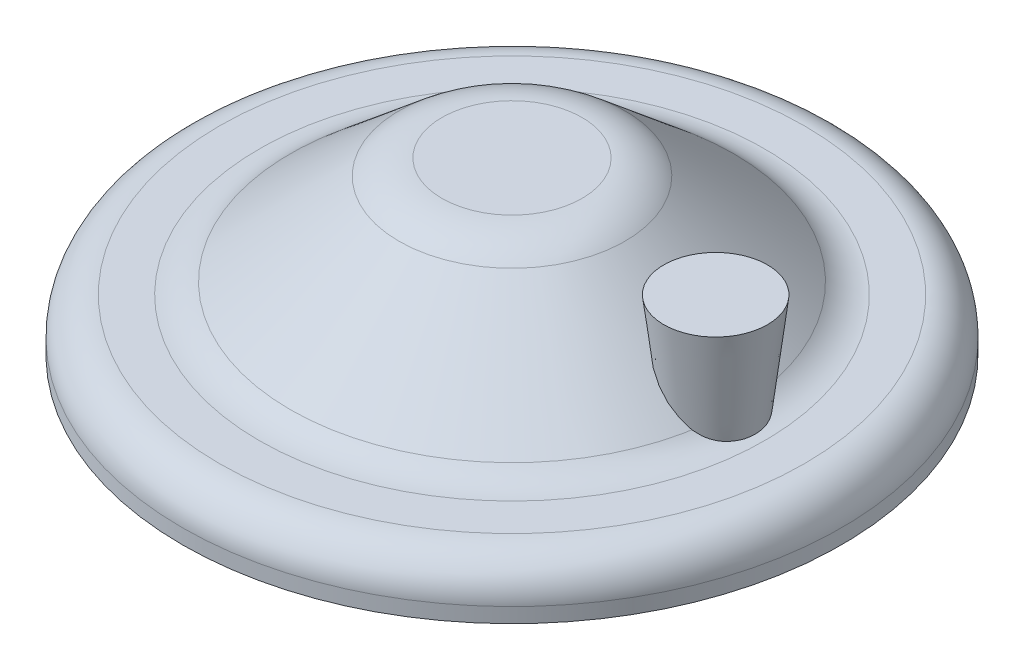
from build123d import *

# Parameters (mm, degrees)
FILLET1_R = 0.8


with BuildPart() as part:
    # Sketch1 → Revolve-Thin1 (revolve)
    with BuildSketch(Plane(origin=(0, 0, 0), x_dir=(1, 0, 0), z_dir=(0, 0, -1)), mode=Mode.PRIVATE) as revolve_thin1_sk:
        with BuildLine():
            Line((89, 14), (89, 10))
            ThreePointArc((89, 10), (86.071067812, 2.928932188), (79, 0))
            Line((79, 0), (68.244581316, 0))
            ThreePointArc((68.244581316, 0), (63.787563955, -0.787915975), (59.870816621, -3.056154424))
            Line((59.870816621, -3.056154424), (30.52502314, -27.768401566))
            ThreePointArc((30.52502314, -27.768401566), (25.101834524, -30.90903942), (18.930579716, -32))
            Line((18.930579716, -32), (0, -32))
            Line((0, -32), (0, -25.65))
            Line((0, -25.65), (18.930579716, -25.65))
            ThreePointArc((18.930579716, -25.65), (22.924752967, -24.943906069), (26.434761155, -22.911215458))
            Line((26.434761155, -22.911215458), (55.780554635, 1.801031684))
            ThreePointArc((55.780554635, 1.801031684), (61.610482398, 5.177217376), (68.244581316, 6.35))
            Line((68.244581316, 6.35), (79, 6.35))
            ThreePointArc((79, 6.35), (81.580939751, 7.419060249), (82.65, 10))
            Line((82.65, 10), (82.65, 14))
            Line((82.65, 14), (89, 14))
        make_face()
    revolve(revolve_thin1_sk.sketch.rotate(Axis((0, 32, 0), (0, -1, 0)), 90), axis=Axis((0, 32, 0), (0, -1, 0)))


with BuildPart() as body_2:
    # Sketch2 → Revolve1 (revolve)
    with BuildSketch(Plane.XY, mode=Mode.PRIVATE) as revolve1_sk:
        Polygon((41, 27.5), (55, 27.5), (55, -1.5), (44.5, -1.5), align=None)
    revolve(revolve1_sk.sketch.rotate(Axis((55, 27.5, 0), (0, 1, 0)), 180), axis=Axis((55, 27.5, 0), (0, 1, 0)))

    # Fillet1
    fillet1_edges = [body_2.edges().sort_by_distance(p)[0] for p in [
        (44.5, -1.5, 0),
    ]]
    fillet(fillet1_edges, radius=FILLET1_R)


solid = Compound([part.part, body_2.part])
